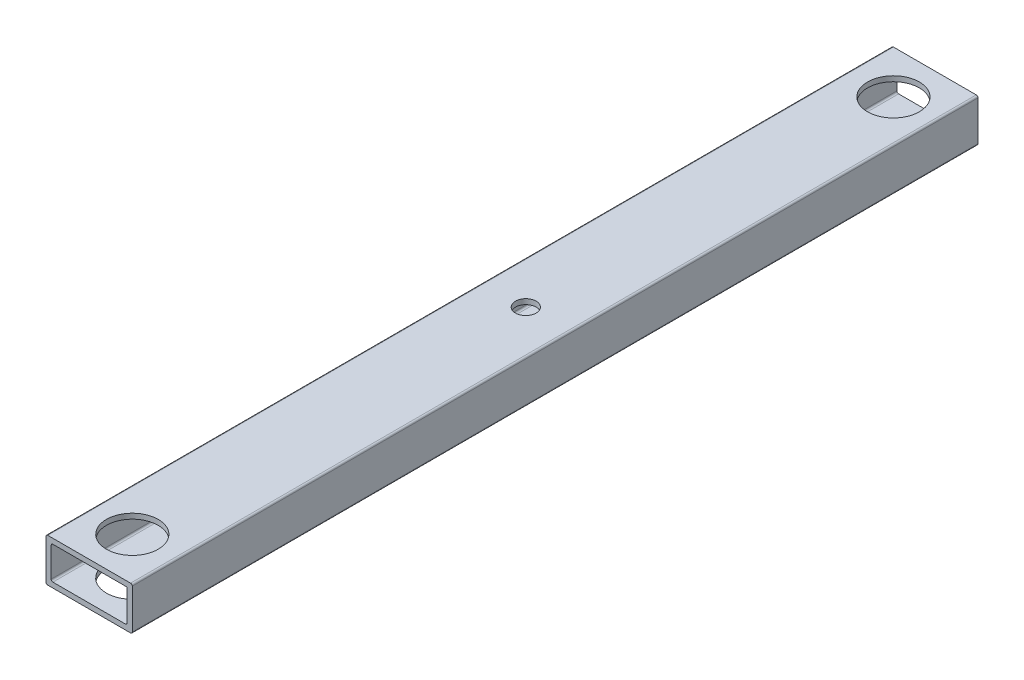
ISO-10303-21;
HEADER;
FILE_DESCRIPTION(('STEP AP214'),'2;1');
FILE_NAME('part.step','',(''),(''),'','','');
FILE_SCHEMA(('AUTOMOTIVE_DESIGN { 1 0 10303 214 1 1 1 1 }'));
ENDSEC;
DATA;
#1=APPLICATION_CONTEXT('core data for automotive mechanical design processes');
#2=APPLICATION_PROTOCOL_DEFINITION('international standard','automotive_design',2000,#1);
#3=PRODUCT_CONTEXT('',#1,'mechanical');
#4=PRODUCT('Part','Part','',(#3));
#5=PRODUCT_RELATED_PRODUCT_CATEGORY('part','',(#4));
#6=PRODUCT_DEFINITION_FORMATION('','',#4);
#7=PRODUCT_DEFINITION_CONTEXT('part definition',#1,'design');
#8=PRODUCT_DEFINITION('design','',#6,#7);
#9=PRODUCT_DEFINITION_SHAPE('','',#8);
#10=(LENGTH_UNIT() NAMED_UNIT(*) SI_UNIT(.MILLI.,.METRE.));
#11=(NAMED_UNIT(*) PLANE_ANGLE_UNIT() SI_UNIT($,.RADIAN.));
#12=(NAMED_UNIT(*) SI_UNIT($,.STERADIAN.) SOLID_ANGLE_UNIT());
#13=UNCERTAINTY_MEASURE_WITH_UNIT(LENGTH_MEASURE(1.E-05),#10,'distance_accuracy_value','');
#14=(GEOMETRIC_REPRESENTATION_CONTEXT(3) GLOBAL_UNCERTAINTY_ASSIGNED_CONTEXT((#13)) GLOBAL_UNIT_ASSIGNED_CONTEXT((#10,
#11,#12)) REPRESENTATION_CONTEXT('',''));
#15=CARTESIAN_POINT('',(0.,0.,0.));
#16=DIRECTION('',(0.,0.,1.));
#17=DIRECTION('',(1.,0.,0.));
#18=AXIS2_PLACEMENT_3D('',#15,#16,#17);
#19=CARTESIAN_POINT('',(1.,24.,490.));
#20=DIRECTION('',(0.,0.,-1.));
#21=DIRECTION('',(-1.,0.,0.));
#22=AXIS2_PLACEMENT_3D('',#19,#20,#21);
#23=PLANE('',#22);
#24=CARTESIAN_POINT('',(1.,24.,490.));
#25=DIRECTION('',(0.,0.,1.));
#26=DIRECTION('',(-1.,0.,0.));
#27=AXIS2_PLACEMENT_3D('',#24,#25,#26);
#28=CIRCLE('',#27,0.999999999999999);
#29=CARTESIAN_POINT('',(1.,25.,490.));
#30=VERTEX_POINT('',#29);
#31=CARTESIAN_POINT('',(0.,24.,490.));
#32=VERTEX_POINT('',#31);
#33=EDGE_CURVE('E217',#30,#32,#28,.T.);
#34=ORIENTED_EDGE('',*,*,#33,.T.);
#35=DIRECTION('',(0.,-1.,0.));
#36=VECTOR('',#35,1.);
#37=CARTESIAN_POINT('',(0.,1.,490.));
#38=LINE('',#37,#36);
#39=CARTESIAN_POINT('',(0.,1.,490.));
#40=VERTEX_POINT('',#39);
#41=EDGE_CURVE('E220',#32,#40,#38,.T.);
#42=ORIENTED_EDGE('',*,*,#41,.T.);
#43=CARTESIAN_POINT('',(1.,1.,490.));
#44=DIRECTION('',(0.,0.,1.));
#45=DIRECTION('',(-1.,0.,0.));
#46=AXIS2_PLACEMENT_3D('',#43,#44,#45);
#47=CIRCLE('',#46,1.);
#48=CARTESIAN_POINT('',(1.,0.,490.));
#49=VERTEX_POINT('',#48);
#50=EDGE_CURVE('E222',#40,#49,#47,.T.);
#51=ORIENTED_EDGE('',*,*,#50,.T.);
#52=DIRECTION('',(1.,0.,0.));
#53=VECTOR('',#52,1.);
#54=CARTESIAN_POINT('',(1.,0.,490.));
#55=LINE('',#54,#53);
#56=CARTESIAN_POINT('',(49.,0.,490.));
#57=VERTEX_POINT('',#56);
#58=EDGE_CURVE('E224',#49,#57,#55,.T.);
#59=ORIENTED_EDGE('',*,*,#58,.T.);
#60=CARTESIAN_POINT('',(49.,1.,490.));
#61=DIRECTION('',(0.,0.,1.));
#62=DIRECTION('',(1.,0.,0.));
#63=AXIS2_PLACEMENT_3D('',#60,#61,#62);
#64=CIRCLE('',#63,1.);
#65=CARTESIAN_POINT('',(50.,1.,490.));
#66=VERTEX_POINT('',#65);
#67=EDGE_CURVE('E226',#57,#66,#64,.T.);
#68=ORIENTED_EDGE('',*,*,#67,.T.);
#69=DIRECTION('',(0.,1.,0.));
#70=VECTOR('',#69,1.);
#71=CARTESIAN_POINT('',(50.,1.,490.));
#72=LINE('',#71,#70);
#73=CARTESIAN_POINT('',(50.,24.,490.));
#74=VERTEX_POINT('',#73);
#75=EDGE_CURVE('E228',#66,#74,#72,.T.);
#76=ORIENTED_EDGE('',*,*,#75,.T.);
#77=CARTESIAN_POINT('',(49.,24.,490.));
#78=DIRECTION('',(0.,0.,1.));
#79=DIRECTION('',(1.,0.,0.));
#80=AXIS2_PLACEMENT_3D('',#77,#78,#79);
#81=CIRCLE('',#80,0.999999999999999);
#82=CARTESIAN_POINT('',(49.,25.,490.));
#83=VERTEX_POINT('',#82);
#84=EDGE_CURVE('E230',#74,#83,#81,.T.);
#85=ORIENTED_EDGE('',*,*,#84,.T.);
#86=DIRECTION('',(-1.,0.,0.));
#87=VECTOR('',#86,1.);
#88=CARTESIAN_POINT('',(1.,25.,490.));
#89=LINE('',#88,#87);
#90=EDGE_CURVE('E232',#83,#30,#89,.T.);
#91=ORIENTED_EDGE('',*,*,#90,.T.);
#92=EDGE_LOOP('',(#34,#42,#51,#59,#68,#76,#85,#91));
#93=FACE_BOUND('',#92,.T.);
#94=DIRECTION('',(0.,1.,0.));
#95=VECTOR('',#94,1.);
#96=CARTESIAN_POINT('',(47.,4.,490.));
#97=LINE('',#96,#95);
#98=CARTESIAN_POINT('',(47.,4.,490.));
#99=VERTEX_POINT('',#98);
#100=CARTESIAN_POINT('',(47.,22.,490.));
#101=VERTEX_POINT('',#100);
#102=EDGE_CURVE('E154',#99,#101,#97,.T.);
#103=ORIENTED_EDGE('',*,*,#102,.F.);
#104=CARTESIAN_POINT('',(46.,4.,490.));
#105=DIRECTION('',(0.,0.,1.));
#106=DIRECTION('',(-1.,0.,0.));
#107=AXIS2_PLACEMENT_3D('',#104,#105,#106);
#108=CIRCLE('',#107,1.);
#109=CARTESIAN_POINT('',(46.,3.,490.));
#110=VERTEX_POINT('',#109);
#111=EDGE_CURVE('E189',#110,#99,#108,.T.);
#112=ORIENTED_EDGE('',*,*,#111,.F.);
#113=DIRECTION('',(1.,0.,0.));
#114=VECTOR('',#113,1.);
#115=CARTESIAN_POINT('',(4.,3.,490.));
#116=LINE('',#115,#114);
#117=CARTESIAN_POINT('',(4.,3.,490.));
#118=VERTEX_POINT('',#117);
#119=EDGE_CURVE('E187',#118,#110,#116,.T.);
#120=ORIENTED_EDGE('',*,*,#119,.F.);
#121=CARTESIAN_POINT('',(4.,4.,490.));
#122=DIRECTION('',(0.,0.,1.));
#123=DIRECTION('',(-1.,0.,0.));
#124=AXIS2_PLACEMENT_3D('',#121,#122,#123);
#125=CIRCLE('',#124,1.);
#126=CARTESIAN_POINT('',(3.,4.,490.));
#127=VERTEX_POINT('',#126);
#128=EDGE_CURVE('E185',#127,#118,#125,.T.);
#129=ORIENTED_EDGE('',*,*,#128,.F.);
#130=DIRECTION('',(0.,-1.,0.));
#131=VECTOR('',#130,1.);
#132=CARTESIAN_POINT('',(3.,4.,490.));
#133=LINE('',#132,#131);
#134=CARTESIAN_POINT('',(3.,21.,490.));
#135=VERTEX_POINT('',#134);
#136=EDGE_CURVE('E183',#135,#127,#133,.T.);
#137=ORIENTED_EDGE('',*,*,#136,.F.);
#138=CARTESIAN_POINT('',(4.,21.,490.));
#139=DIRECTION('',(0.,0.,1.));
#140=DIRECTION('',(-1.,0.,0.));
#141=AXIS2_PLACEMENT_3D('',#138,#139,#140);
#142=CIRCLE('',#141,1.);
#143=CARTESIAN_POINT('',(4.,22.,490.));
#144=VERTEX_POINT('',#143);
#145=EDGE_CURVE('E181',#144,#135,#142,.T.);
#146=ORIENTED_EDGE('',*,*,#145,.F.);
#147=DIRECTION('',(-1.,0.,0.));
#148=VECTOR('',#147,1.);
#149=CARTESIAN_POINT('',(4.,22.,490.));
#150=LINE('',#149,#148);
#151=EDGE_CURVE('E179',#101,#144,#150,.T.);
#152=ORIENTED_EDGE('',*,*,#151,.F.);
#153=EDGE_LOOP('',(#103,#112,#120,#129,#137,#146,#152));
#154=FACE_BOUND('',#153,.T.);
#155=ADVANCED_FACE('F30',(#93,#154),#23,.F.);
#156=CARTESIAN_POINT('',(1.,24.,0.));
#157=DIRECTION('',(0.,0.,-1.));
#158=DIRECTION('',(-1.,0.,0.));
#159=AXIS2_PLACEMENT_3D('',#156,#157,#158);
#160=PLANE('',#159);
#161=CARTESIAN_POINT('',(1.,24.,0.));
#162=DIRECTION('',(0.,0.,1.));
#163=DIRECTION('',(-1.,0.,0.));
#164=AXIS2_PLACEMENT_3D('',#161,#162,#163);
#165=CIRCLE('',#164,0.999999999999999);
#166=CARTESIAN_POINT('',(1.,25.,0.));
#167=VERTEX_POINT('',#166);
#168=CARTESIAN_POINT('',(0.,24.,0.));
#169=VERTEX_POINT('',#168);
#170=EDGE_CURVE('E155',#167,#169,#165,.T.);
#171=ORIENTED_EDGE('',*,*,#170,.F.);
#172=DIRECTION('',(-1.,0.,0.));
#173=VECTOR('',#172,1.);
#174=CARTESIAN_POINT('',(1.,25.,0.));
#175=LINE('',#174,#173);
#176=CARTESIAN_POINT('',(49.,25.,0.));
#177=VERTEX_POINT('',#176);
#178=EDGE_CURVE('E215',#177,#167,#175,.T.);
#179=ORIENTED_EDGE('',*,*,#178,.F.);
#180=CARTESIAN_POINT('',(49.,24.,0.));
#181=DIRECTION('',(0.,0.,1.));
#182=DIRECTION('',(1.,0.,0.));
#183=AXIS2_PLACEMENT_3D('',#180,#181,#182);
#184=CIRCLE('',#183,0.999999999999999);
#185=CARTESIAN_POINT('',(50.,24.,0.));
#186=VERTEX_POINT('',#185);
#187=EDGE_CURVE('E213',#186,#177,#184,.T.);
#188=ORIENTED_EDGE('',*,*,#187,.F.);
#189=DIRECTION('',(0.,1.,0.));
#190=VECTOR('',#189,1.);
#191=CARTESIAN_POINT('',(50.,1.,0.));
#192=LINE('',#191,#190);
#193=CARTESIAN_POINT('',(50.,1.,0.));
#194=VERTEX_POINT('',#193);
#195=EDGE_CURVE('E211',#194,#186,#192,.T.);
#196=ORIENTED_EDGE('',*,*,#195,.F.);
#197=CARTESIAN_POINT('',(49.,1.,0.));
#198=DIRECTION('',(0.,0.,1.));
#199=DIRECTION('',(1.,0.,0.));
#200=AXIS2_PLACEMENT_3D('',#197,#198,#199);
#201=CIRCLE('',#200,1.);
#202=CARTESIAN_POINT('',(49.,0.,0.));
#203=VERTEX_POINT('',#202);
#204=EDGE_CURVE('E209',#203,#194,#201,.T.);
#205=ORIENTED_EDGE('',*,*,#204,.F.);
#206=DIRECTION('',(1.,0.,0.));
#207=VECTOR('',#206,1.);
#208=CARTESIAN_POINT('',(1.,0.,0.));
#209=LINE('',#208,#207);
#210=CARTESIAN_POINT('',(1.,0.,0.));
#211=VERTEX_POINT('',#210);
#212=EDGE_CURVE('E207',#211,#203,#209,.T.);
#213=ORIENTED_EDGE('',*,*,#212,.F.);
#214=CARTESIAN_POINT('',(1.,1.,0.));
#215=DIRECTION('',(0.,0.,1.));
#216=DIRECTION('',(-1.,0.,0.));
#217=AXIS2_PLACEMENT_3D('',#214,#215,#216);
#218=CIRCLE('',#217,1.);
#219=CARTESIAN_POINT('',(0.,1.,0.));
#220=VERTEX_POINT('',#219);
#221=EDGE_CURVE('E205',#220,#211,#218,.T.);
#222=ORIENTED_EDGE('',*,*,#221,.F.);
#223=DIRECTION('',(0.,-1.,0.));
#224=VECTOR('',#223,1.);
#225=CARTESIAN_POINT('',(0.,1.,0.));
#226=LINE('',#225,#224);
#227=EDGE_CURVE('E203',#169,#220,#226,.T.);
#228=ORIENTED_EDGE('',*,*,#227,.F.);
#229=EDGE_LOOP('',(#171,#179,#188,#196,#205,#213,#222,#228));
#230=FACE_BOUND('',#229,.T.);
#231=CARTESIAN_POINT('',(46.,4.,0.));
#232=DIRECTION('',(0.,0.,1.));
#233=DIRECTION('',(-1.,0.,0.));
#234=AXIS2_PLACEMENT_3D('',#231,#232,#233);
#235=CIRCLE('',#234,1.);
#236=CARTESIAN_POINT('',(46.,3.,0.));
#237=VERTEX_POINT('',#236);
#238=CARTESIAN_POINT('',(47.,4.,0.));
#239=VERTEX_POINT('',#238);
#240=EDGE_CURVE('E160',#237,#239,#235,.T.);
#241=ORIENTED_EDGE('',*,*,#240,.T.);
#242=DIRECTION('',(0.,1.,0.));
#243=VECTOR('',#242,1.);
#244=CARTESIAN_POINT('',(47.,4.,0.));
#245=LINE('',#244,#243);
#246=CARTESIAN_POINT('',(47.,22.,0.));
#247=VERTEX_POINT('',#246);
#248=EDGE_CURVE('E55',#239,#247,#245,.T.);
#249=ORIENTED_EDGE('',*,*,#248,.T.);
#250=DIRECTION('',(-1.,0.,0.));
#251=VECTOR('',#250,1.);
#252=CARTESIAN_POINT('',(4.,22.,0.));
#253=LINE('',#252,#251);
#254=CARTESIAN_POINT('',(4.,22.,0.));
#255=VERTEX_POINT('',#254);
#256=EDGE_CURVE('E141',#247,#255,#253,.T.);
#257=ORIENTED_EDGE('',*,*,#256,.T.);
#258=CARTESIAN_POINT('',(4.,21.,0.));
#259=DIRECTION('',(0.,0.,1.));
#260=DIRECTION('',(-1.,0.,0.));
#261=AXIS2_PLACEMENT_3D('',#258,#259,#260);
#262=CIRCLE('',#261,1.);
#263=CARTESIAN_POINT('',(3.,21.,0.));
#264=VERTEX_POINT('',#263);
#265=EDGE_CURVE('E150',#255,#264,#262,.T.);
#266=ORIENTED_EDGE('',*,*,#265,.T.);
#267=DIRECTION('',(0.,-1.,0.));
#268=VECTOR('',#267,1.);
#269=CARTESIAN_POINT('',(3.,4.,0.));
#270=LINE('',#269,#268);
#271=CARTESIAN_POINT('',(3.,4.,0.));
#272=VERTEX_POINT('',#271);
#273=EDGE_CURVE('E169',#264,#272,#270,.T.);
#274=ORIENTED_EDGE('',*,*,#273,.T.);
#275=CARTESIAN_POINT('',(4.,4.,0.));
#276=DIRECTION('',(0.,0.,1.));
#277=DIRECTION('',(-1.,0.,0.));
#278=AXIS2_PLACEMENT_3D('',#275,#276,#277);
#279=CIRCLE('',#278,1.);
#280=CARTESIAN_POINT('',(4.,3.,0.));
#281=VERTEX_POINT('',#280);
#282=EDGE_CURVE('E172',#272,#281,#279,.T.);
#283=ORIENTED_EDGE('',*,*,#282,.T.);
#284=DIRECTION('',(1.,0.,0.));
#285=VECTOR('',#284,1.);
#286=CARTESIAN_POINT('',(4.,3.,0.));
#287=LINE('',#286,#285);
#288=EDGE_CURVE('E175',#281,#237,#287,.T.);
#289=ORIENTED_EDGE('',*,*,#288,.T.);
#290=EDGE_LOOP('',(#241,#249,#257,#266,#274,#283,#289));
#291=FACE_BOUND('',#290,.T.);
#292=ADVANCED_FACE('F158',(#230,#291),#160,.T.);
#293=CARTESIAN_POINT('',(1.,24.,490.));
#294=DIRECTION('',(0.,0.,-1.));
#295=DIRECTION('',(-1.,0.,0.));
#296=AXIS2_PLACEMENT_3D('',#293,#294,#295);
#297=CYLINDRICAL_SURFACE('',#296,0.999999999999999);
#298=ORIENTED_EDGE('',*,*,#170,.T.);
#299=DIRECTION('',(0.,0.,-1.));
#300=VECTOR('',#299,1.);
#301=CARTESIAN_POINT('',(0.,24.,490.));
#302=LINE('',#301,#300);
#303=EDGE_CURVE('E11',#32,#169,#302,.T.);
#304=ORIENTED_EDGE('',*,*,#303,.F.);
#305=ORIENTED_EDGE('',*,*,#33,.F.);
#306=DIRECTION('',(0.,0.,-1.));
#307=VECTOR('',#306,1.);
#308=CARTESIAN_POINT('',(1.,25.,490.));
#309=LINE('',#308,#307);
#310=EDGE_CURVE('E234',#30,#167,#309,.T.);
#311=ORIENTED_EDGE('',*,*,#310,.T.);
#312=EDGE_LOOP('',(#298,#304,#305,#311));
#313=FACE_BOUND('',#312,.T.);
#314=ADVANCED_FACE('F32',(#313),#297,.T.);
#315=CARTESIAN_POINT('',(0.,1.,490.));
#316=DIRECTION('',(1.,0.,0.));
#317=DIRECTION('',(0.,0.,-1.));
#318=AXIS2_PLACEMENT_3D('',#315,#316,#317);
#319=PLANE('',#318);
#320=ORIENTED_EDGE('',*,*,#227,.T.);
#321=DIRECTION('',(0.,0.,-1.));
#322=VECTOR('',#321,1.);
#323=CARTESIAN_POINT('',(0.,1.,490.));
#324=LINE('',#323,#322);
#325=EDGE_CURVE('E39',#40,#220,#324,.T.);
#326=ORIENTED_EDGE('',*,*,#325,.F.);
#327=ORIENTED_EDGE('',*,*,#41,.F.);
#328=ORIENTED_EDGE('',*,*,#303,.T.);
#329=EDGE_LOOP('',(#320,#326,#327,#328));
#330=FACE_BOUND('',#329,.T.);
#331=ADVANCED_FACE('F329',(#330),#319,.F.);
#332=CARTESIAN_POINT('',(1.,1.,490.));
#333=DIRECTION('',(0.,0.,-1.));
#334=DIRECTION('',(-1.,0.,0.));
#335=AXIS2_PLACEMENT_3D('',#332,#333,#334);
#336=CYLINDRICAL_SURFACE('',#335,1.);
#337=ORIENTED_EDGE('',*,*,#221,.T.);
#338=DIRECTION('',(0.,0.,-1.));
#339=VECTOR('',#338,1.);
#340=CARTESIAN_POINT('',(1.,0.,490.));
#341=LINE('',#340,#339);
#342=EDGE_CURVE('E249',#49,#211,#341,.T.);
#343=ORIENTED_EDGE('',*,*,#342,.F.);
#344=ORIENTED_EDGE('',*,*,#50,.F.);
#345=ORIENTED_EDGE('',*,*,#325,.T.);
#346=EDGE_LOOP('',(#337,#343,#344,#345));
#347=FACE_BOUND('',#346,.T.);
#348=ADVANCED_FACE('F326',(#347),#336,.T.);
#349=CARTESIAN_POINT('',(1.,0.,490.));
#350=DIRECTION('',(0.,1.,0.));
#351=DIRECTION('',(0.,0.,1.));
#352=AXIS2_PLACEMENT_3D('',#349,#350,#351);
#353=PLANE('',#352);
#354=CARTESIAN_POINT('',(25.0000000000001,0.,465.));
#355=DIRECTION('',(0.,1.,0.));
#356=DIRECTION('',(0.,0.,1.));
#357=AXIS2_PLACEMENT_3D('',#354,#355,#356);
#358=CIRCLE('',#357,15.);
#359=CARTESIAN_POINT('',(25.0000000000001,0.,480.));
#360=VERTEX_POINT('',#359);
#361=EDGE_CURVE('E515',#360,#360,#358,.T.);
#362=ORIENTED_EDGE('',*,*,#361,.T.);
#363=EDGE_LOOP('',(#362));
#364=FACE_BOUND('',#363,.T.);
#365=CARTESIAN_POINT('',(25.,0.,237.));
#366=DIRECTION('',(0.,1.,0.));
#367=DIRECTION('',(0.,0.,1.));
#368=AXIS2_PLACEMENT_3D('',#365,#366,#367);
#369=CIRCLE('',#368,6.00000000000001);
#370=CARTESIAN_POINT('',(25.,0.,243.));
#371=VERTEX_POINT('',#370);
#372=EDGE_CURVE('E259',#371,#371,#369,.T.);
#373=ORIENTED_EDGE('',*,*,#372,.T.);
#374=EDGE_LOOP('',(#373));
#375=FACE_BOUND('',#374,.T.);
#376=CARTESIAN_POINT('',(26.,0.,25.));
#377=DIRECTION('',(0.,1.,0.));
#378=DIRECTION('',(0.,0.,1.));
#379=AXIS2_PLACEMENT_3D('',#376,#377,#378);
#380=CIRCLE('',#379,15.);
#381=CARTESIAN_POINT('',(26.,0.,40.));
#382=VERTEX_POINT('',#381);
#383=EDGE_CURVE('E255',#382,#382,#380,.T.);
#384=ORIENTED_EDGE('',*,*,#383,.T.);
#385=EDGE_LOOP('',(#384));
#386=FACE_BOUND('',#385,.T.);
#387=ORIENTED_EDGE('',*,*,#212,.T.);
#388=DIRECTION('',(0.,0.,-1.));
#389=VECTOR('',#388,1.);
#390=CARTESIAN_POINT('',(49.,0.,490.));
#391=LINE('',#390,#389);
#392=EDGE_CURVE('E246',#57,#203,#391,.T.);
#393=ORIENTED_EDGE('',*,*,#392,.F.);
#394=ORIENTED_EDGE('',*,*,#58,.F.);
#395=ORIENTED_EDGE('',*,*,#342,.T.);
#396=EDGE_LOOP('',(#387,#393,#394,#395));
#397=FACE_BOUND('',#396,.T.);
#398=ADVANCED_FACE('F279',(#364,#375,#386,#397),#353,.F.);
#399=CARTESIAN_POINT('',(49.,1.,490.));
#400=DIRECTION('',(0.,0.,-1.));
#401=DIRECTION('',(-1.,0.,0.));
#402=AXIS2_PLACEMENT_3D('',#399,#400,#401);
#403=CYLINDRICAL_SURFACE('',#402,1.);
#404=ORIENTED_EDGE('',*,*,#204,.T.);
#405=DIRECTION('',(0.,0.,-1.));
#406=VECTOR('',#405,1.);
#407=CARTESIAN_POINT('',(50.,1.,490.));
#408=LINE('',#407,#406);
#409=EDGE_CURVE('E243',#66,#194,#408,.T.);
#410=ORIENTED_EDGE('',*,*,#409,.F.);
#411=ORIENTED_EDGE('',*,*,#67,.F.);
#412=ORIENTED_EDGE('',*,*,#392,.T.);
#413=EDGE_LOOP('',(#404,#410,#411,#412));
#414=FACE_BOUND('',#413,.T.);
#415=ADVANCED_FACE('F319',(#414),#403,.T.);
#416=CARTESIAN_POINT('',(50.,1.,490.));
#417=DIRECTION('',(-1.,0.,0.));
#418=DIRECTION('',(0.,0.,1.));
#419=AXIS2_PLACEMENT_3D('',#416,#417,#418);
#420=PLANE('',#419);
#421=ORIENTED_EDGE('',*,*,#195,.T.);
#422=DIRECTION('',(0.,0.,-1.));
#423=VECTOR('',#422,1.);
#424=CARTESIAN_POINT('',(50.,24.,490.));
#425=LINE('',#424,#423);
#426=EDGE_CURVE('E240',#74,#186,#425,.T.);
#427=ORIENTED_EDGE('',*,*,#426,.F.);
#428=ORIENTED_EDGE('',*,*,#75,.F.);
#429=ORIENTED_EDGE('',*,*,#409,.T.);
#430=EDGE_LOOP('',(#421,#427,#428,#429));
#431=FACE_BOUND('',#430,.T.);
#432=ADVANCED_FACE('F315',(#431),#420,.F.);
#433=CARTESIAN_POINT('',(49.,24.,490.));
#434=DIRECTION('',(0.,0.,-1.));
#435=DIRECTION('',(-1.,0.,0.));
#436=AXIS2_PLACEMENT_3D('',#433,#434,#435);
#437=CYLINDRICAL_SURFACE('',#436,0.999999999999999);
#438=ORIENTED_EDGE('',*,*,#187,.T.);
#439=DIRECTION('',(0.,0.,-1.));
#440=VECTOR('',#439,1.);
#441=CARTESIAN_POINT('',(49.,25.,490.));
#442=LINE('',#441,#440);
#443=EDGE_CURVE('E237',#83,#177,#442,.T.);
#444=ORIENTED_EDGE('',*,*,#443,.F.);
#445=ORIENTED_EDGE('',*,*,#84,.F.);
#446=ORIENTED_EDGE('',*,*,#426,.T.);
#447=EDGE_LOOP('',(#438,#444,#445,#446));
#448=FACE_BOUND('',#447,.T.);
#449=ADVANCED_FACE('F311',(#448),#437,.T.);
#450=CARTESIAN_POINT('',(1.,25.,490.));
#451=DIRECTION('',(0.,-1.,0.));
#452=DIRECTION('',(0.,0.,-1.));
#453=AXIS2_PLACEMENT_3D('',#450,#451,#452);
#454=PLANE('',#453);
#455=CARTESIAN_POINT('',(25.0000000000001,25.,465.));
#456=DIRECTION('',(0.,1.,0.));
#457=DIRECTION('',(0.,0.,1.));
#458=AXIS2_PLACEMENT_3D('',#455,#456,#457);
#459=CIRCLE('',#458,15.);
#460=CARTESIAN_POINT('',(25.0000000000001,25.,480.));
#461=VERTEX_POINT('',#460);
#462=EDGE_CURVE('E514',#461,#461,#459,.T.);
#463=ORIENTED_EDGE('',*,*,#462,.F.);
#464=EDGE_LOOP('',(#463));
#465=FACE_BOUND('',#464,.T.);
#466=CARTESIAN_POINT('',(25.,25.,237.));
#467=DIRECTION('',(0.,1.,0.));
#468=DIRECTION('',(0.,0.,1.));
#469=AXIS2_PLACEMENT_3D('',#466,#467,#468);
#470=CIRCLE('',#469,6.00000000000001);
#471=CARTESIAN_POINT('',(25.,25.,243.));
#472=VERTEX_POINT('',#471);
#473=EDGE_CURVE('E266',#472,#472,#470,.T.);
#474=ORIENTED_EDGE('',*,*,#473,.F.);
#475=EDGE_LOOP('',(#474));
#476=FACE_BOUND('',#475,.T.);
#477=CARTESIAN_POINT('',(26.,25.,25.));
#478=DIRECTION('',(0.,1.,0.));
#479=DIRECTION('',(0.,0.,1.));
#480=AXIS2_PLACEMENT_3D('',#477,#478,#479);
#481=CIRCLE('',#480,15.);
#482=CARTESIAN_POINT('',(26.,25.,40.));
#483=VERTEX_POINT('',#482);
#484=EDGE_CURVE('E263',#483,#483,#481,.T.);
#485=ORIENTED_EDGE('',*,*,#484,.F.);
#486=EDGE_LOOP('',(#485));
#487=FACE_BOUND('',#486,.T.);
#488=ORIENTED_EDGE('',*,*,#178,.T.);
#489=ORIENTED_EDGE('',*,*,#310,.F.);
#490=ORIENTED_EDGE('',*,*,#90,.F.);
#491=ORIENTED_EDGE('',*,*,#443,.T.);
#492=EDGE_LOOP('',(#488,#489,#490,#491));
#493=FACE_BOUND('',#492,.T.);
#494=ADVANCED_FACE('F308',(#465,#476,#487,#493),#454,.F.);
#495=CARTESIAN_POINT('',(47.,4.,490.));
#496=DIRECTION('',(-1.,0.,0.));
#497=DIRECTION('',(0.,0.,1.));
#498=AXIS2_PLACEMENT_3D('',#495,#496,#497);
#499=PLANE('',#498);
#500=ORIENTED_EDGE('',*,*,#248,.F.);
#501=DIRECTION('',(0.,0.,-1.));
#502=VECTOR('',#501,1.);
#503=CARTESIAN_POINT('',(47.,4.,490.));
#504=LINE('',#503,#502);
#505=EDGE_CURVE('E191',#99,#239,#504,.T.);
#506=ORIENTED_EDGE('',*,*,#505,.F.);
#507=ORIENTED_EDGE('',*,*,#102,.T.);
#508=DIRECTION('',(0.,0.,-1.));
#509=VECTOR('',#508,1.);
#510=CARTESIAN_POINT('',(47.,22.,490.));
#511=LINE('',#510,#509);
#512=EDGE_CURVE('E143',#101,#247,#511,.T.);
#513=ORIENTED_EDGE('',*,*,#512,.T.);
#514=EDGE_LOOP('',(#500,#506,#507,#513));
#515=FACE_BOUND('',#514,.T.);
#516=ADVANCED_FACE('F152',(#515),#499,.T.);
#517=CARTESIAN_POINT('',(4.,22.,490.));
#518=DIRECTION('',(0.,-1.,0.));
#519=DIRECTION('',(0.,0.,-1.));
#520=AXIS2_PLACEMENT_3D('',#517,#518,#519);
#521=PLANE('',#520);
#522=CARTESIAN_POINT('',(25.0000000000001,22.,465.));
#523=DIRECTION('',(0.,-1.,0.));
#524=DIRECTION('',(0.,0.,-1.));
#525=AXIS2_PLACEMENT_3D('',#522,#523,#524);
#526=CIRCLE('',#525,15.);
#527=CARTESIAN_POINT('',(25.0000000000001,22.,480.));
#528=VERTEX_POINT('',#527);
#529=EDGE_CURVE('E271',#528,#528,#526,.T.);
#530=ORIENTED_EDGE('',*,*,#529,.F.);
#531=EDGE_LOOP('',(#530));
#532=FACE_BOUND('',#531,.T.);
#533=CARTESIAN_POINT('',(25.,22.,237.));
#534=DIRECTION('',(0.,-1.,0.));
#535=DIRECTION('',(0.,0.,-1.));
#536=AXIS2_PLACEMENT_3D('',#533,#534,#535);
#537=CIRCLE('',#536,6.00000000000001);
#538=CARTESIAN_POINT('',(25.,22.,243.));
#539=VERTEX_POINT('',#538);
#540=EDGE_CURVE('E258',#539,#539,#537,.T.);
#541=ORIENTED_EDGE('',*,*,#540,.F.);
#542=EDGE_LOOP('',(#541));
#543=FACE_BOUND('',#542,.T.);
#544=CARTESIAN_POINT('',(26.,22.,25.));
#545=DIRECTION('',(0.,-1.,0.));
#546=DIRECTION('',(0.,0.,-1.));
#547=AXIS2_PLACEMENT_3D('',#544,#545,#546);
#548=CIRCLE('',#547,15.);
#549=CARTESIAN_POINT('',(26.,22.,40.));
#550=VERTEX_POINT('',#549);
#551=EDGE_CURVE('E161',#550,#550,#548,.T.);
#552=ORIENTED_EDGE('',*,*,#551,.F.);
#553=EDGE_LOOP('',(#552));
#554=FACE_BOUND('',#553,.T.);
#555=ORIENTED_EDGE('',*,*,#256,.F.);
#556=ORIENTED_EDGE('',*,*,#512,.F.);
#557=ORIENTED_EDGE('',*,*,#151,.T.);
#558=DIRECTION('',(0.,0.,-1.));
#559=VECTOR('',#558,1.);
#560=CARTESIAN_POINT('',(4.,22.,490.));
#561=LINE('',#560,#559);
#562=EDGE_CURVE('E146',#144,#255,#561,.T.);
#563=ORIENTED_EDGE('',*,*,#562,.T.);
#564=EDGE_LOOP('',(#555,#556,#557,#563));
#565=FACE_BOUND('',#564,.T.);
#566=ADVANCED_FACE('F142',(#532,#543,#554,#565),#521,.T.);
#567=CARTESIAN_POINT('',(4.,21.,490.));
#568=DIRECTION('',(0.,0.,-1.));
#569=DIRECTION('',(-1.,0.,0.));
#570=AXIS2_PLACEMENT_3D('',#567,#568,#569);
#571=CYLINDRICAL_SURFACE('',#570,1.);
#572=ORIENTED_EDGE('',*,*,#265,.F.);
#573=ORIENTED_EDGE('',*,*,#562,.F.);
#574=ORIENTED_EDGE('',*,*,#145,.T.);
#575=DIRECTION('',(0.,0.,-1.));
#576=VECTOR('',#575,1.);
#577=CARTESIAN_POINT('',(3.,21.,490.));
#578=LINE('',#577,#576);
#579=EDGE_CURVE('E198',#135,#264,#578,.T.);
#580=ORIENTED_EDGE('',*,*,#579,.T.);
#581=EDGE_LOOP('',(#572,#573,#574,#580));
#582=FACE_BOUND('',#581,.T.);
#583=ADVANCED_FACE('F424',(#582),#571,.F.);
#584=CARTESIAN_POINT('',(3.,4.,490.));
#585=DIRECTION('',(1.,0.,0.));
#586=DIRECTION('',(0.,0.,-1.));
#587=AXIS2_PLACEMENT_3D('',#584,#585,#586);
#588=PLANE('',#587);
#589=ORIENTED_EDGE('',*,*,#273,.F.);
#590=ORIENTED_EDGE('',*,*,#579,.F.);
#591=ORIENTED_EDGE('',*,*,#136,.T.);
#592=DIRECTION('',(0.,0.,-1.));
#593=VECTOR('',#592,1.);
#594=CARTESIAN_POINT('',(3.,4.,490.));
#595=LINE('',#594,#593);
#596=EDGE_CURVE('E196',#127,#272,#595,.T.);
#597=ORIENTED_EDGE('',*,*,#596,.T.);
#598=EDGE_LOOP('',(#589,#590,#591,#597));
#599=FACE_BOUND('',#598,.T.);
#600=ADVANCED_FACE('F433',(#599),#588,.T.);
#601=CARTESIAN_POINT('',(4.,4.,490.));
#602=DIRECTION('',(0.,0.,-1.));
#603=DIRECTION('',(-1.,0.,0.));
#604=AXIS2_PLACEMENT_3D('',#601,#602,#603);
#605=CYLINDRICAL_SURFACE('',#604,1.);
#606=ORIENTED_EDGE('',*,*,#282,.F.);
#607=ORIENTED_EDGE('',*,*,#596,.F.);
#608=ORIENTED_EDGE('',*,*,#128,.T.);
#609=DIRECTION('',(0.,0.,-1.));
#610=VECTOR('',#609,1.);
#611=CARTESIAN_POINT('',(4.,3.,490.));
#612=LINE('',#611,#610);
#613=EDGE_CURVE('E194',#118,#281,#612,.T.);
#614=ORIENTED_EDGE('',*,*,#613,.T.);
#615=EDGE_LOOP('',(#606,#607,#608,#614));
#616=FACE_BOUND('',#615,.T.);
#617=ADVANCED_FACE('F442',(#616),#605,.F.);
#618=CARTESIAN_POINT('',(4.,3.,490.));
#619=DIRECTION('',(0.,1.,0.));
#620=DIRECTION('',(0.,0.,1.));
#621=AXIS2_PLACEMENT_3D('',#618,#619,#620);
#622=PLANE('',#621);
#623=CARTESIAN_POINT('',(25.0000000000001,3.,465.));
#624=DIRECTION('',(0.,1.,0.));
#625=DIRECTION('',(0.,0.,1.));
#626=AXIS2_PLACEMENT_3D('',#623,#624,#625);
#627=CIRCLE('',#626,15.);
#628=CARTESIAN_POINT('',(25.0000000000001,3.,480.));
#629=VERTEX_POINT('',#628);
#630=EDGE_CURVE('E34',#629,#629,#627,.T.);
#631=ORIENTED_EDGE('',*,*,#630,.F.);
#632=EDGE_LOOP('',(#631));
#633=FACE_BOUND('',#632,.T.);
#634=CARTESIAN_POINT('',(25.,3.,237.));
#635=DIRECTION('',(0.,1.,0.));
#636=DIRECTION('',(0.,0.,1.));
#637=AXIS2_PLACEMENT_3D('',#634,#635,#636);
#638=CIRCLE('',#637,6.00000000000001);
#639=CARTESIAN_POINT('',(25.,3.,243.));
#640=VERTEX_POINT('',#639);
#641=EDGE_CURVE('E256',#640,#640,#638,.T.);
#642=ORIENTED_EDGE('',*,*,#641,.F.);
#643=EDGE_LOOP('',(#642));
#644=FACE_BOUND('',#643,.T.);
#645=CARTESIAN_POINT('',(26.,3.,25.));
#646=DIRECTION('',(0.,1.,0.));
#647=DIRECTION('',(0.,0.,1.));
#648=AXIS2_PLACEMENT_3D('',#645,#646,#647);
#649=CIRCLE('',#648,15.);
#650=CARTESIAN_POINT('',(26.,3.,40.));
#651=VERTEX_POINT('',#650);
#652=EDGE_CURVE('E164',#651,#651,#649,.T.);
#653=ORIENTED_EDGE('',*,*,#652,.F.);
#654=EDGE_LOOP('',(#653));
#655=FACE_BOUND('',#654,.T.);
#656=ORIENTED_EDGE('',*,*,#288,.F.);
#657=ORIENTED_EDGE('',*,*,#613,.F.);
#658=ORIENTED_EDGE('',*,*,#119,.T.);
#659=DIRECTION('',(0.,0.,-1.));
#660=VECTOR('',#659,1.);
#661=CARTESIAN_POINT('',(46.,3.,490.));
#662=LINE('',#661,#660);
#663=EDGE_CURVE('E47',#110,#237,#662,.T.);
#664=ORIENTED_EDGE('',*,*,#663,.T.);
#665=EDGE_LOOP('',(#656,#657,#658,#664));
#666=FACE_BOUND('',#665,.T.);
#667=ADVANCED_FACE('F294',(#633,#644,#655,#666),#622,.T.);
#668=CARTESIAN_POINT('',(46.,4.,490.));
#669=DIRECTION('',(0.,0.,-1.));
#670=DIRECTION('',(-1.,0.,0.));
#671=AXIS2_PLACEMENT_3D('',#668,#669,#670);
#672=CYLINDRICAL_SURFACE('',#671,1.);
#673=ORIENTED_EDGE('',*,*,#240,.F.);
#674=ORIENTED_EDGE('',*,*,#663,.F.);
#675=ORIENTED_EDGE('',*,*,#111,.T.);
#676=ORIENTED_EDGE('',*,*,#505,.T.);
#677=EDGE_LOOP('',(#673,#674,#675,#676));
#678=FACE_BOUND('',#677,.T.);
#679=ADVANCED_FACE('F285',(#678),#672,.F.);
#680=CARTESIAN_POINT('',(26.,0.,25.));
#681=DIRECTION('',(0.,1.,0.));
#682=DIRECTION('',(0.,0.,1.));
#683=AXIS2_PLACEMENT_3D('',#680,#681,#682);
#684=CYLINDRICAL_SURFACE('',#683,15.);
#685=CARTESIAN_POINT('',(26.,3.,40.));
#686=CARTESIAN_POINT('',(26.,2.96875,40.));
#687=CARTESIAN_POINT('',(26.,2.9375,40.));
#688=CARTESIAN_POINT('',(26.,2.875,40.));
#689=CARTESIAN_POINT('',(26.,2.84375,40.));
#690=CARTESIAN_POINT('',(26.,2.78125,40.));
#691=CARTESIAN_POINT('',(26.,2.75,40.));
#692=CARTESIAN_POINT('',(26.,2.6875,40.));
#693=CARTESIAN_POINT('',(26.,2.65625,40.));
#694=CARTESIAN_POINT('',(26.,2.59375,40.));
#695=CARTESIAN_POINT('',(26.,2.5625,40.));
#696=CARTESIAN_POINT('',(26.,2.5,40.));
#697=CARTESIAN_POINT('',(26.,2.46875,40.));
#698=CARTESIAN_POINT('',(26.,2.40625,40.));
#699=CARTESIAN_POINT('',(26.,2.375,40.));
#700=CARTESIAN_POINT('',(26.,2.3125,40.));
#701=CARTESIAN_POINT('',(26.,2.28125,40.));
#702=CARTESIAN_POINT('',(26.,2.21875,40.));
#703=CARTESIAN_POINT('',(26.,2.1875,40.));
#704=CARTESIAN_POINT('',(26.,2.125,40.));
#705=CARTESIAN_POINT('',(26.,2.09375,40.));
#706=CARTESIAN_POINT('',(26.,2.03125,40.));
#707=CARTESIAN_POINT('',(26.,2.,40.));
#708=CARTESIAN_POINT('',(26.,1.9375,40.));
#709=CARTESIAN_POINT('',(26.,1.90625,40.));
#710=CARTESIAN_POINT('',(26.,1.84375,40.));
#711=CARTESIAN_POINT('',(26.,1.8125,40.));
#712=CARTESIAN_POINT('',(26.,1.75,40.));
#713=CARTESIAN_POINT('',(26.,1.71875,40.));
#714=CARTESIAN_POINT('',(26.,1.65625,40.));
#715=CARTESIAN_POINT('',(26.,1.625,40.));
#716=CARTESIAN_POINT('',(26.,1.5625,40.));
#717=CARTESIAN_POINT('',(26.,1.53125,40.));
#718=CARTESIAN_POINT('',(26.,1.46875,40.));
#719=CARTESIAN_POINT('',(26.,1.4375,40.));
#720=CARTESIAN_POINT('',(26.,1.375,40.));
#721=CARTESIAN_POINT('',(26.,1.34375,40.));
#722=CARTESIAN_POINT('',(26.,1.28125,40.));
#723=CARTESIAN_POINT('',(26.,1.25,40.));
#724=CARTESIAN_POINT('',(26.,1.1875,40.));
#725=CARTESIAN_POINT('',(26.,1.15625,40.));
#726=CARTESIAN_POINT('',(26.,1.09375,40.));
#727=CARTESIAN_POINT('',(26.,1.0625,40.));
#728=CARTESIAN_POINT('',(26.,1.,40.));
#729=CARTESIAN_POINT('',(26.,0.96875,40.));
#730=CARTESIAN_POINT('',(26.,0.90625,40.));
#731=CARTESIAN_POINT('',(26.,0.875,40.));
#732=CARTESIAN_POINT('',(26.,0.8125,40.));
#733=CARTESIAN_POINT('',(26.,0.78125,40.));
#734=CARTESIAN_POINT('',(26.,0.71875,40.));
#735=CARTESIAN_POINT('',(26.,0.6875,40.));
#736=CARTESIAN_POINT('',(26.,0.625,40.));
#737=CARTESIAN_POINT('',(26.,0.59375,40.));
#738=CARTESIAN_POINT('',(26.,0.53125,40.));
#739=CARTESIAN_POINT('',(26.,0.5,40.));
#740=CARTESIAN_POINT('',(26.,0.4375,40.));
#741=CARTESIAN_POINT('',(26.,0.40625,40.));
#742=CARTESIAN_POINT('',(26.,0.34375,40.));
#743=CARTESIAN_POINT('',(26.,0.3125,40.));
#744=CARTESIAN_POINT('',(26.,0.25,40.));
#745=CARTESIAN_POINT('',(26.,0.21875,40.));
#746=CARTESIAN_POINT('',(26.,0.15625,40.));
#747=CARTESIAN_POINT('',(26.,0.125,40.));
#748=CARTESIAN_POINT('',(26.,0.0625000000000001,40.));
#749=CARTESIAN_POINT('',(26.,0.03125,40.));
#750=CARTESIAN_POINT('',(26.,0.,40.));
#751=B_SPLINE_CURVE_WITH_KNOTS('',3,(#685,#686,#687,#688,#689,#690,#691,#692,#693,#694,#695,
#696,#697,#698,#699,#700,#701,#702,#703,#704,#705,#706,#707,#708,#709,#710,#711,#712,#713,#714,
#715,#716,#717,#718,#719,#720,#721,#722,#723,#724,#725,#726,#727,#728,#729,#730,#731,#732,#733,
#734,#735,#736,#737,#738,#739,#740,#741,#742,#743,#744,#745,#746,#747,#748,#749,#750),
.UNSPECIFIED.,.F.,.F.,(4,2,2,2,2,2,2,2,2,2,2,2,2,2,2,2,2,2,2,2,2,2,2,2,2,2,2,2,2,2,2,2,4),(0.,
0.0937500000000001,0.1875,0.28125,0.375,0.46875,0.5625,0.65625,0.75,0.84375,0.9375,1.03125,
1.125,1.21875,1.3125,1.40625,1.5,1.59375,1.6875,1.78125,1.875,1.96875,2.0625,2.15625,2.25,
2.34375,2.4375,2.53125,2.625,2.71875,2.8125,2.90625,3.),.UNSPECIFIED.);
#752=EDGE_CURVE('BSEAM282',#651,#382,#751,.T.);
#753=ORIENTED_EDGE('',*,*,#652,.T.);
#754=ORIENTED_EDGE('',*,*,#383,.F.);
#755=ORIENTED_EDGE('',*,*,#752,.T.);
#756=ORIENTED_EDGE('',*,*,#752,.F.);
#757=EDGE_LOOP('',(#753,#755,#754,#756));
#758=FACE_BOUND('',#757,.T.);
#759=ADVANCED_FACE('F282',(#758),#684,.F.);
#760=CARTESIAN_POINT('',(26.,22.,40.));
#761=CARTESIAN_POINT('',(26.,22.03125,40.));
#762=CARTESIAN_POINT('',(26.,22.0625,40.));
#763=CARTESIAN_POINT('',(26.,22.125,40.));
#764=CARTESIAN_POINT('',(26.,22.15625,40.));
#765=CARTESIAN_POINT('',(26.,22.21875,40.));
#766=CARTESIAN_POINT('',(26.,22.25,40.));
#767=CARTESIAN_POINT('',(26.,22.3125,40.));
#768=CARTESIAN_POINT('',(26.,22.34375,40.));
#769=CARTESIAN_POINT('',(26.,22.40625,40.));
#770=CARTESIAN_POINT('',(26.,22.4375,40.));
#771=CARTESIAN_POINT('',(26.,22.5,40.));
#772=CARTESIAN_POINT('',(26.,22.53125,40.));
#773=CARTESIAN_POINT('',(26.,22.59375,40.));
#774=CARTESIAN_POINT('',(26.,22.625,40.));
#775=CARTESIAN_POINT('',(26.,22.6875,40.));
#776=CARTESIAN_POINT('',(26.,22.71875,40.));
#777=CARTESIAN_POINT('',(26.,22.78125,40.));
#778=CARTESIAN_POINT('',(26.,22.8125,40.));
#779=CARTESIAN_POINT('',(26.,22.875,40.));
#780=CARTESIAN_POINT('',(26.,22.90625,40.));
#781=CARTESIAN_POINT('',(26.,22.96875,40.));
#782=CARTESIAN_POINT('',(26.,23.,40.));
#783=CARTESIAN_POINT('',(26.,23.0625,40.));
#784=CARTESIAN_POINT('',(26.,23.09375,40.));
#785=CARTESIAN_POINT('',(26.,23.15625,40.));
#786=CARTESIAN_POINT('',(26.,23.1875,40.));
#787=CARTESIAN_POINT('',(26.,23.25,40.));
#788=CARTESIAN_POINT('',(26.,23.28125,40.));
#789=CARTESIAN_POINT('',(26.,23.34375,40.));
#790=CARTESIAN_POINT('',(26.,23.375,40.));
#791=CARTESIAN_POINT('',(26.,23.4375,40.));
#792=CARTESIAN_POINT('',(26.,23.46875,40.));
#793=CARTESIAN_POINT('',(26.,23.53125,40.));
#794=CARTESIAN_POINT('',(26.,23.5625,40.));
#795=CARTESIAN_POINT('',(26.,23.625,40.));
#796=CARTESIAN_POINT('',(26.,23.65625,40.));
#797=CARTESIAN_POINT('',(26.,23.71875,40.));
#798=CARTESIAN_POINT('',(26.,23.75,40.));
#799=CARTESIAN_POINT('',(26.,23.8125,40.));
#800=CARTESIAN_POINT('',(26.,23.84375,40.));
#801=CARTESIAN_POINT('',(26.,23.90625,40.));
#802=CARTESIAN_POINT('',(26.,23.9375,40.));
#803=CARTESIAN_POINT('',(26.,24.,40.));
#804=CARTESIAN_POINT('',(26.,24.03125,40.));
#805=CARTESIAN_POINT('',(26.,24.09375,40.));
#806=CARTESIAN_POINT('',(26.,24.125,40.));
#807=CARTESIAN_POINT('',(26.,24.1875,40.));
#808=CARTESIAN_POINT('',(26.,24.21875,40.));
#809=CARTESIAN_POINT('',(26.,24.28125,40.));
#810=CARTESIAN_POINT('',(26.,24.3125,40.));
#811=CARTESIAN_POINT('',(26.,24.375,40.));
#812=CARTESIAN_POINT('',(26.,24.40625,40.));
#813=CARTESIAN_POINT('',(26.,24.46875,40.));
#814=CARTESIAN_POINT('',(26.,24.5,40.));
#815=CARTESIAN_POINT('',(26.,24.5625,40.));
#816=CARTESIAN_POINT('',(26.,24.59375,40.));
#817=CARTESIAN_POINT('',(26.,24.65625,40.));
#818=CARTESIAN_POINT('',(26.,24.6875,40.));
#819=CARTESIAN_POINT('',(26.,24.75,40.));
#820=CARTESIAN_POINT('',(26.,24.78125,40.));
#821=CARTESIAN_POINT('',(26.,24.84375,40.));
#822=CARTESIAN_POINT('',(26.,24.875,40.));
#823=CARTESIAN_POINT('',(26.,24.9375,40.));
#824=CARTESIAN_POINT('',(26.,24.96875,40.));
#825=CARTESIAN_POINT('',(26.,25.,40.));
#826=B_SPLINE_CURVE_WITH_KNOTS('',3,(#760,#761,#762,#763,#764,#765,#766,#767,#768,#769,#770,
#771,#772,#773,#774,#775,#776,#777,#778,#779,#780,#781,#782,#783,#784,#785,#786,#787,#788,#789,
#790,#791,#792,#793,#794,#795,#796,#797,#798,#799,#800,#801,#802,#803,#804,#805,#806,#807,#808,
#809,#810,#811,#812,#813,#814,#815,#816,#817,#818,#819,#820,#821,#822,#823,#824,#825),
.UNSPECIFIED.,.F.,.F.,(4,2,2,2,2,2,2,2,2,2,2,2,2,2,2,2,2,2,2,2,2,2,2,2,2,2,2,2,2,2,2,2,4),(0.,
0.0937500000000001,0.1875,0.28125,0.375,0.46875,0.5625,0.656250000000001,0.750000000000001,
0.843749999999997,0.937499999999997,1.03125,1.125,1.21875,1.3125,1.40625,1.5,1.59375,1.6875,
1.78125,1.875,1.96875,2.0625,2.15625,2.25,2.34375,2.4375,2.53125,2.625,2.71875,2.8125,2.90625,
3.),.UNSPECIFIED.);
#827=EDGE_CURVE('BSEAM284',#550,#483,#826,.T.);
#828=ORIENTED_EDGE('',*,*,#551,.T.);
#829=ORIENTED_EDGE('',*,*,#484,.T.);
#830=ORIENTED_EDGE('',*,*,#827,.T.);
#831=ORIENTED_EDGE('',*,*,#827,.F.);
#832=EDGE_LOOP('',(#828,#830,#829,#831));
#833=FACE_BOUND('',#832,.T.);
#834=ADVANCED_FACE('F284',(#833),#684,.F.);
#835=CARTESIAN_POINT('',(25.,0.,237.));
#836=DIRECTION('',(0.,1.,0.));
#837=DIRECTION('',(0.,0.,1.));
#838=AXIS2_PLACEMENT_3D('',#835,#836,#837);
#839=CYLINDRICAL_SURFACE('',#838,6.00000000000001);
#840=CARTESIAN_POINT('',(25.,3.,243.));
#841=CARTESIAN_POINT('',(25.,2.96875,243.));
#842=CARTESIAN_POINT('',(25.,2.9375,243.));
#843=CARTESIAN_POINT('',(25.,2.875,243.));
#844=CARTESIAN_POINT('',(25.,2.84375,243.));
#845=CARTESIAN_POINT('',(25.,2.78125,243.));
#846=CARTESIAN_POINT('',(25.,2.75,243.));
#847=CARTESIAN_POINT('',(25.,2.6875,243.));
#848=CARTESIAN_POINT('',(25.,2.65625,243.));
#849=CARTESIAN_POINT('',(25.,2.59375,243.));
#850=CARTESIAN_POINT('',(25.,2.5625,243.));
#851=CARTESIAN_POINT('',(25.,2.5,243.));
#852=CARTESIAN_POINT('',(25.,2.46875,243.));
#853=CARTESIAN_POINT('',(25.,2.40625,243.));
#854=CARTESIAN_POINT('',(25.,2.375,243.));
#855=CARTESIAN_POINT('',(25.,2.3125,243.));
#856=CARTESIAN_POINT('',(25.,2.28125,243.));
#857=CARTESIAN_POINT('',(25.,2.21875,243.));
#858=CARTESIAN_POINT('',(25.,2.1875,243.));
#859=CARTESIAN_POINT('',(25.,2.125,243.));
#860=CARTESIAN_POINT('',(25.,2.09375,243.));
#861=CARTESIAN_POINT('',(25.,2.03125,243.));
#862=CARTESIAN_POINT('',(25.,2.,243.));
#863=CARTESIAN_POINT('',(25.,1.9375,243.));
#864=CARTESIAN_POINT('',(25.,1.90625,243.));
#865=CARTESIAN_POINT('',(25.,1.84375,243.));
#866=CARTESIAN_POINT('',(25.,1.8125,243.));
#867=CARTESIAN_POINT('',(25.,1.75,243.));
#868=CARTESIAN_POINT('',(25.,1.71875,243.));
#869=CARTESIAN_POINT('',(25.,1.65625,243.));
#870=CARTESIAN_POINT('',(25.,1.625,243.));
#871=CARTESIAN_POINT('',(25.,1.5625,243.));
#872=CARTESIAN_POINT('',(25.,1.53125,243.));
#873=CARTESIAN_POINT('',(25.,1.46875,243.));
#874=CARTESIAN_POINT('',(25.,1.4375,243.));
#875=CARTESIAN_POINT('',(25.,1.375,243.));
#876=CARTESIAN_POINT('',(25.,1.34375,243.));
#877=CARTESIAN_POINT('',(25.,1.28125,243.));
#878=CARTESIAN_POINT('',(25.,1.25,243.));
#879=CARTESIAN_POINT('',(25.,1.1875,243.));
#880=CARTESIAN_POINT('',(25.,1.15625,243.));
#881=CARTESIAN_POINT('',(25.,1.09375,243.));
#882=CARTESIAN_POINT('',(25.,1.0625,243.));
#883=CARTESIAN_POINT('',(25.,1.,243.));
#884=CARTESIAN_POINT('',(25.,0.96875,243.));
#885=CARTESIAN_POINT('',(25.,0.90625,243.));
#886=CARTESIAN_POINT('',(25.,0.875,243.));
#887=CARTESIAN_POINT('',(25.,0.8125,243.));
#888=CARTESIAN_POINT('',(25.,0.78125,243.));
#889=CARTESIAN_POINT('',(25.,0.71875,243.));
#890=CARTESIAN_POINT('',(25.,0.6875,243.));
#891=CARTESIAN_POINT('',(25.,0.625,243.));
#892=CARTESIAN_POINT('',(25.,0.59375,243.));
#893=CARTESIAN_POINT('',(25.,0.53125,243.));
#894=CARTESIAN_POINT('',(25.,0.5,243.));
#895=CARTESIAN_POINT('',(25.,0.4375,243.));
#896=CARTESIAN_POINT('',(25.,0.40625,243.));
#897=CARTESIAN_POINT('',(25.,0.34375,243.));
#898=CARTESIAN_POINT('',(25.,0.3125,243.));
#899=CARTESIAN_POINT('',(25.,0.25,243.));
#900=CARTESIAN_POINT('',(25.,0.21875,243.));
#901=CARTESIAN_POINT('',(25.,0.15625,243.));
#902=CARTESIAN_POINT('',(25.,0.125,243.));
#903=CARTESIAN_POINT('',(25.,0.0625000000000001,243.));
#904=CARTESIAN_POINT('',(25.,0.03125,243.));
#905=CARTESIAN_POINT('',(25.,0.,243.));
#906=B_SPLINE_CURVE_WITH_KNOTS('',3,(#840,#841,#842,#843,#844,#845,#846,#847,#848,#849,#850,
#851,#852,#853,#854,#855,#856,#857,#858,#859,#860,#861,#862,#863,#864,#865,#866,#867,#868,#869,
#870,#871,#872,#873,#874,#875,#876,#877,#878,#879,#880,#881,#882,#883,#884,#885,#886,#887,#888,
#889,#890,#891,#892,#893,#894,#895,#896,#897,#898,#899,#900,#901,#902,#903,#904,#905),
.UNSPECIFIED.,.F.,.F.,(4,2,2,2,2,2,2,2,2,2,2,2,2,2,2,2,2,2,2,2,2,2,2,2,2,2,2,2,2,2,2,2,4),(0.,
0.0937500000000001,0.1875,0.28125,0.375,0.46875,0.5625,0.65625,0.75,0.84375,0.9375,1.03125,
1.125,1.21875,1.3125,1.40625,1.5,1.59375,1.6875,1.78125,1.875,1.96875,2.0625,2.15625,2.25,
2.34375,2.4375,2.53125,2.625,2.71875,2.8125,2.90625,3.),.UNSPECIFIED.);
#907=EDGE_CURVE('BSEAM292',#640,#371,#906,.T.);
#908=ORIENTED_EDGE('',*,*,#641,.T.);
#909=ORIENTED_EDGE('',*,*,#372,.F.);
#910=ORIENTED_EDGE('',*,*,#907,.T.);
#911=ORIENTED_EDGE('',*,*,#907,.F.);
#912=EDGE_LOOP('',(#908,#910,#909,#911));
#913=FACE_BOUND('',#912,.T.);
#914=ADVANCED_FACE('F292',(#913),#839,.F.);
#915=CARTESIAN_POINT('',(25.,22.,243.));
#916=CARTESIAN_POINT('',(25.,22.03125,243.));
#917=CARTESIAN_POINT('',(25.,22.0625,243.));
#918=CARTESIAN_POINT('',(25.,22.125,243.));
#919=CARTESIAN_POINT('',(25.,22.15625,243.));
#920=CARTESIAN_POINT('',(25.,22.21875,243.));
#921=CARTESIAN_POINT('',(25.,22.25,243.));
#922=CARTESIAN_POINT('',(25.,22.3125,243.));
#923=CARTESIAN_POINT('',(25.,22.34375,243.));
#924=CARTESIAN_POINT('',(25.,22.40625,243.));
#925=CARTESIAN_POINT('',(25.,22.4375,243.));
#926=CARTESIAN_POINT('',(25.,22.5,243.));
#927=CARTESIAN_POINT('',(25.,22.53125,243.));
#928=CARTESIAN_POINT('',(25.,22.59375,243.));
#929=CARTESIAN_POINT('',(25.,22.625,243.));
#930=CARTESIAN_POINT('',(25.,22.6875,243.));
#931=CARTESIAN_POINT('',(25.,22.71875,243.));
#932=CARTESIAN_POINT('',(25.,22.78125,243.));
#933=CARTESIAN_POINT('',(25.,22.8125,243.));
#934=CARTESIAN_POINT('',(25.,22.875,243.));
#935=CARTESIAN_POINT('',(25.,22.90625,243.));
#936=CARTESIAN_POINT('',(25.,22.96875,243.));
#937=CARTESIAN_POINT('',(25.,23.,243.));
#938=CARTESIAN_POINT('',(25.,23.0625,243.));
#939=CARTESIAN_POINT('',(25.,23.09375,243.));
#940=CARTESIAN_POINT('',(25.,23.15625,243.));
#941=CARTESIAN_POINT('',(25.,23.1875,243.));
#942=CARTESIAN_POINT('',(25.,23.25,243.));
#943=CARTESIAN_POINT('',(25.,23.28125,243.));
#944=CARTESIAN_POINT('',(25.,23.34375,243.));
#945=CARTESIAN_POINT('',(25.,23.375,243.));
#946=CARTESIAN_POINT('',(25.,23.4375,243.));
#947=CARTESIAN_POINT('',(25.,23.46875,243.));
#948=CARTESIAN_POINT('',(25.,23.53125,243.));
#949=CARTESIAN_POINT('',(25.,23.5625,243.));
#950=CARTESIAN_POINT('',(25.,23.625,243.));
#951=CARTESIAN_POINT('',(25.,23.65625,243.));
#952=CARTESIAN_POINT('',(25.,23.71875,243.));
#953=CARTESIAN_POINT('',(25.,23.75,243.));
#954=CARTESIAN_POINT('',(25.,23.8125,243.));
#955=CARTESIAN_POINT('',(25.,23.84375,243.));
#956=CARTESIAN_POINT('',(25.,23.90625,243.));
#957=CARTESIAN_POINT('',(25.,23.9375,243.));
#958=CARTESIAN_POINT('',(25.,24.,243.));
#959=CARTESIAN_POINT('',(25.,24.03125,243.));
#960=CARTESIAN_POINT('',(25.,24.09375,243.));
#961=CARTESIAN_POINT('',(25.,24.125,243.));
#962=CARTESIAN_POINT('',(25.,24.1875,243.));
#963=CARTESIAN_POINT('',(25.,24.21875,243.));
#964=CARTESIAN_POINT('',(25.,24.28125,243.));
#965=CARTESIAN_POINT('',(25.,24.3125,243.));
#966=CARTESIAN_POINT('',(25.,24.375,243.));
#967=CARTESIAN_POINT('',(25.,24.40625,243.));
#968=CARTESIAN_POINT('',(25.,24.46875,243.));
#969=CARTESIAN_POINT('',(25.,24.5,243.));
#970=CARTESIAN_POINT('',(25.,24.5625,243.));
#971=CARTESIAN_POINT('',(25.,24.59375,243.));
#972=CARTESIAN_POINT('',(25.,24.65625,243.));
#973=CARTESIAN_POINT('',(25.,24.6875,243.));
#974=CARTESIAN_POINT('',(25.,24.75,243.));
#975=CARTESIAN_POINT('',(25.,24.78125,243.));
#976=CARTESIAN_POINT('',(25.,24.84375,243.));
#977=CARTESIAN_POINT('',(25.,24.875,243.));
#978=CARTESIAN_POINT('',(25.,24.9375,243.));
#979=CARTESIAN_POINT('',(25.,24.96875,243.));
#980=CARTESIAN_POINT('',(25.,25.,243.));
#981=B_SPLINE_CURVE_WITH_KNOTS('',3,(#915,#916,#917,#918,#919,#920,#921,#922,#923,#924,#925,
#926,#927,#928,#929,#930,#931,#932,#933,#934,#935,#936,#937,#938,#939,#940,#941,#942,#943,#944,
#945,#946,#947,#948,#949,#950,#951,#952,#953,#954,#955,#956,#957,#958,#959,#960,#961,#962,#963,
#964,#965,#966,#967,#968,#969,#970,#971,#972,#973,#974,#975,#976,#977,#978,#979,#980),
.UNSPECIFIED.,.F.,.F.,(4,2,2,2,2,2,2,2,2,2,2,2,2,2,2,2,2,2,2,2,2,2,2,2,2,2,2,2,2,2,2,2,4),(0.,
0.0937500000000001,0.1875,0.28125,0.375,0.46875,0.5625,0.656250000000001,0.750000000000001,
0.843749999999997,0.937499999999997,1.03125,1.125,1.21875,1.3125,1.40625,1.5,1.59375,1.6875,
1.78125,1.875,1.96875,2.0625,2.15625,2.25,2.34375,2.4375,2.53125,2.625,2.71875,2.8125,2.90625,
3.),.UNSPECIFIED.);
#982=EDGE_CURVE('BSEAM479',#539,#472,#981,.T.);
#983=ORIENTED_EDGE('',*,*,#540,.T.);
#984=ORIENTED_EDGE('',*,*,#473,.T.);
#985=ORIENTED_EDGE('',*,*,#982,.T.);
#986=ORIENTED_EDGE('',*,*,#982,.F.);
#987=EDGE_LOOP('',(#983,#985,#984,#986));
#988=FACE_BOUND('',#987,.T.);
#989=ADVANCED_FACE('F479',(#988),#839,.F.);
#990=CARTESIAN_POINT('',(25.0000000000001,0.,465.));
#991=DIRECTION('',(0.,1.,0.));
#992=DIRECTION('',(0.,0.,1.));
#993=AXIS2_PLACEMENT_3D('',#990,#991,#992);
#994=CYLINDRICAL_SURFACE('',#993,15.);
#995=CARTESIAN_POINT('',(25.0000000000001,3.,480.));
#996=CARTESIAN_POINT('',(25.0000000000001,2.96875,480.));
#997=CARTESIAN_POINT('',(25.0000000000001,2.9375,480.));
#998=CARTESIAN_POINT('',(25.0000000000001,2.875,480.));
#999=CARTESIAN_POINT('',(25.0000000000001,2.84375,480.));
#1000=CARTESIAN_POINT('',(25.0000000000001,2.78125,480.));
#1001=CARTESIAN_POINT('',(25.0000000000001,2.75,480.));
#1002=CARTESIAN_POINT('',(25.0000000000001,2.6875,480.));
#1003=CARTESIAN_POINT('',(25.0000000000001,2.65625,480.));
#1004=CARTESIAN_POINT('',(25.0000000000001,2.59375,480.));
#1005=CARTESIAN_POINT('',(25.0000000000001,2.5625,480.));
#1006=CARTESIAN_POINT('',(25.0000000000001,2.5,480.));
#1007=CARTESIAN_POINT('',(25.0000000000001,2.46875,480.));
#1008=CARTESIAN_POINT('',(25.0000000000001,2.40625,480.));
#1009=CARTESIAN_POINT('',(25.0000000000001,2.375,480.));
#1010=CARTESIAN_POINT('',(25.0000000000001,2.3125,480.));
#1011=CARTESIAN_POINT('',(25.0000000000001,2.28125,480.));
#1012=CARTESIAN_POINT('',(25.0000000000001,2.21875,480.));
#1013=CARTESIAN_POINT('',(25.0000000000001,2.1875,480.));
#1014=CARTESIAN_POINT('',(25.0000000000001,2.125,480.));
#1015=CARTESIAN_POINT('',(25.0000000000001,2.09375,480.));
#1016=CARTESIAN_POINT('',(25.0000000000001,2.03125,480.));
#1017=CARTESIAN_POINT('',(25.0000000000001,2.,480.));
#1018=CARTESIAN_POINT('',(25.0000000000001,1.9375,480.));
#1019=CARTESIAN_POINT('',(25.0000000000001,1.90625,480.));
#1020=CARTESIAN_POINT('',(25.0000000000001,1.84375,480.));
#1021=CARTESIAN_POINT('',(25.0000000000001,1.8125,480.));
#1022=CARTESIAN_POINT('',(25.0000000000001,1.75,480.));
#1023=CARTESIAN_POINT('',(25.0000000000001,1.71875,480.));
#1024=CARTESIAN_POINT('',(25.0000000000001,1.65625,480.));
#1025=CARTESIAN_POINT('',(25.0000000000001,1.625,480.));
#1026=CARTESIAN_POINT('',(25.0000000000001,1.5625,480.));
#1027=CARTESIAN_POINT('',(25.0000000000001,1.53125,480.));
#1028=CARTESIAN_POINT('',(25.0000000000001,1.46875,480.));
#1029=CARTESIAN_POINT('',(25.0000000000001,1.4375,480.));
#1030=CARTESIAN_POINT('',(25.0000000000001,1.375,480.));
#1031=CARTESIAN_POINT('',(25.0000000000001,1.34375,480.));
#1032=CARTESIAN_POINT('',(25.0000000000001,1.28125,480.));
#1033=CARTESIAN_POINT('',(25.0000000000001,1.25,480.));
#1034=CARTESIAN_POINT('',(25.0000000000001,1.1875,480.));
#1035=CARTESIAN_POINT('',(25.0000000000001,1.15625,480.));
#1036=CARTESIAN_POINT('',(25.0000000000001,1.09375,480.));
#1037=CARTESIAN_POINT('',(25.0000000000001,1.0625,480.));
#1038=CARTESIAN_POINT('',(25.0000000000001,1.,480.));
#1039=CARTESIAN_POINT('',(25.0000000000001,0.96875,480.));
#1040=CARTESIAN_POINT('',(25.0000000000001,0.90625,480.));
#1041=CARTESIAN_POINT('',(25.0000000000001,0.875,480.));
#1042=CARTESIAN_POINT('',(25.0000000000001,0.8125,480.));
#1043=CARTESIAN_POINT('',(25.0000000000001,0.78125,480.));
#1044=CARTESIAN_POINT('',(25.0000000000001,0.71875,480.));
#1045=CARTESIAN_POINT('',(25.0000000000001,0.6875,480.));
#1046=CARTESIAN_POINT('',(25.0000000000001,0.625,480.));
#1047=CARTESIAN_POINT('',(25.0000000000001,0.59375,480.));
#1048=CARTESIAN_POINT('',(25.0000000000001,0.53125,480.));
#1049=CARTESIAN_POINT('',(25.0000000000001,0.5,480.));
#1050=CARTESIAN_POINT('',(25.0000000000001,0.4375,480.));
#1051=CARTESIAN_POINT('',(25.0000000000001,0.40625,480.));
#1052=CARTESIAN_POINT('',(25.0000000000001,0.34375,480.));
#1053=CARTESIAN_POINT('',(25.0000000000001,0.3125,480.));
#1054=CARTESIAN_POINT('',(25.0000000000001,0.25,480.));
#1055=CARTESIAN_POINT('',(25.0000000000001,0.21875,480.));
#1056=CARTESIAN_POINT('',(25.0000000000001,0.15625,480.));
#1057=CARTESIAN_POINT('',(25.0000000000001,0.125,480.));
#1058=CARTESIAN_POINT('',(25.0000000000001,0.0625000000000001,480.));
#1059=CARTESIAN_POINT('',(25.0000000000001,0.03125,480.));
#1060=CARTESIAN_POINT('',(25.0000000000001,0.,480.));
#1061=B_SPLINE_CURVE_WITH_KNOTS('',3,(#995,#996,#997,#998,#999,#1000,#1001,#1002,#1003,#1004,
#1005,#1006,#1007,#1008,#1009,#1010,#1011,#1012,#1013,#1014,#1015,#1016,#1017,#1018,#1019,#1020,
#1021,#1022,#1023,#1024,#1025,#1026,#1027,#1028,#1029,#1030,#1031,#1032,#1033,#1034,#1035,#1036,
#1037,#1038,#1039,#1040,#1041,#1042,#1043,#1044,#1045,#1046,#1047,#1048,#1049,#1050,#1051,#1052,
#1053,#1054,#1055,#1056,#1057,#1058,#1059,#1060),.UNSPECIFIED.,.F.,.F.,(4,2,2,2,2,2,2,2,2,2,2,2,
2,2,2,2,2,2,2,2,2,2,2,2,2,2,2,2,2,2,2,2,4),(0.,0.0937500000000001,0.1875,0.28125,0.375,0.46875,
0.5625,0.65625,0.75,0.84375,0.9375,1.03125,1.125,1.21875,1.3125,1.40625,1.5,1.59375,1.6875,
1.78125,1.875,1.96875,2.0625,2.15625,2.25,2.34375,2.4375,2.53125,2.625,2.71875,2.8125,2.90625,
3.),.UNSPECIFIED.);
#1062=EDGE_CURVE('BSEAM486',#629,#360,#1061,.T.);
#1063=ORIENTED_EDGE('',*,*,#630,.T.);
#1064=ORIENTED_EDGE('',*,*,#361,.F.);
#1065=ORIENTED_EDGE('',*,*,#1062,.T.);
#1066=ORIENTED_EDGE('',*,*,#1062,.F.);
#1067=EDGE_LOOP('',(#1063,#1065,#1064,#1066));
#1068=FACE_BOUND('',#1067,.T.);
#1069=ADVANCED_FACE('F486',(#1068),#994,.F.);
#1070=CARTESIAN_POINT('',(25.0000000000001,22.,480.));
#1071=CARTESIAN_POINT('',(25.0000000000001,22.03125,480.));
#1072=CARTESIAN_POINT('',(25.0000000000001,22.0625,480.));
#1073=CARTESIAN_POINT('',(25.0000000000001,22.125,480.));
#1074=CARTESIAN_POINT('',(25.0000000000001,22.15625,480.));
#1075=CARTESIAN_POINT('',(25.0000000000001,22.21875,480.));
#1076=CARTESIAN_POINT('',(25.0000000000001,22.25,480.));
#1077=CARTESIAN_POINT('',(25.0000000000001,22.3125,480.));
#1078=CARTESIAN_POINT('',(25.0000000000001,22.34375,480.));
#1079=CARTESIAN_POINT('',(25.0000000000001,22.40625,480.));
#1080=CARTESIAN_POINT('',(25.0000000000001,22.4375,480.));
#1081=CARTESIAN_POINT('',(25.0000000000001,22.5,480.));
#1082=CARTESIAN_POINT('',(25.0000000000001,22.53125,480.));
#1083=CARTESIAN_POINT('',(25.0000000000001,22.59375,480.));
#1084=CARTESIAN_POINT('',(25.0000000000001,22.625,480.));
#1085=CARTESIAN_POINT('',(25.0000000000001,22.6875,480.));
#1086=CARTESIAN_POINT('',(25.0000000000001,22.71875,480.));
#1087=CARTESIAN_POINT('',(25.0000000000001,22.78125,480.));
#1088=CARTESIAN_POINT('',(25.0000000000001,22.8125,480.));
#1089=CARTESIAN_POINT('',(25.0000000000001,22.875,480.));
#1090=CARTESIAN_POINT('',(25.0000000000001,22.90625,480.));
#1091=CARTESIAN_POINT('',(25.0000000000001,22.96875,480.));
#1092=CARTESIAN_POINT('',(25.0000000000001,23.,480.));
#1093=CARTESIAN_POINT('',(25.0000000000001,23.0625,480.));
#1094=CARTESIAN_POINT('',(25.0000000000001,23.09375,480.));
#1095=CARTESIAN_POINT('',(25.0000000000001,23.15625,480.));
#1096=CARTESIAN_POINT('',(25.0000000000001,23.1875,480.));
#1097=CARTESIAN_POINT('',(25.0000000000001,23.25,480.));
#1098=CARTESIAN_POINT('',(25.0000000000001,23.28125,480.));
#1099=CARTESIAN_POINT('',(25.0000000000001,23.34375,480.));
#1100=CARTESIAN_POINT('',(25.0000000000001,23.375,480.));
#1101=CARTESIAN_POINT('',(25.0000000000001,23.4375,480.));
#1102=CARTESIAN_POINT('',(25.0000000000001,23.46875,480.));
#1103=CARTESIAN_POINT('',(25.0000000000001,23.53125,480.));
#1104=CARTESIAN_POINT('',(25.0000000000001,23.5625,480.));
#1105=CARTESIAN_POINT('',(25.0000000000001,23.625,480.));
#1106=CARTESIAN_POINT('',(25.0000000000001,23.65625,480.));
#1107=CARTESIAN_POINT('',(25.0000000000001,23.71875,480.));
#1108=CARTESIAN_POINT('',(25.0000000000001,23.75,480.));
#1109=CARTESIAN_POINT('',(25.0000000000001,23.8125,480.));
#1110=CARTESIAN_POINT('',(25.0000000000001,23.84375,480.));
#1111=CARTESIAN_POINT('',(25.0000000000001,23.90625,480.));
#1112=CARTESIAN_POINT('',(25.0000000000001,23.9375,480.));
#1113=CARTESIAN_POINT('',(25.0000000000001,24.,480.));
#1114=CARTESIAN_POINT('',(25.0000000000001,24.03125,480.));
#1115=CARTESIAN_POINT('',(25.0000000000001,24.09375,480.));
#1116=CARTESIAN_POINT('',(25.0000000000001,24.125,480.));
#1117=CARTESIAN_POINT('',(25.0000000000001,24.1875,480.));
#1118=CARTESIAN_POINT('',(25.0000000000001,24.21875,480.));
#1119=CARTESIAN_POINT('',(25.0000000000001,24.28125,480.));
#1120=CARTESIAN_POINT('',(25.0000000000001,24.3125,480.));
#1121=CARTESIAN_POINT('',(25.0000000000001,24.375,480.));
#1122=CARTESIAN_POINT('',(25.0000000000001,24.40625,480.));
#1123=CARTESIAN_POINT('',(25.0000000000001,24.46875,480.));
#1124=CARTESIAN_POINT('',(25.0000000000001,24.5,480.));
#1125=CARTESIAN_POINT('',(25.0000000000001,24.5625,480.));
#1126=CARTESIAN_POINT('',(25.0000000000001,24.59375,480.));
#1127=CARTESIAN_POINT('',(25.0000000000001,24.65625,480.));
#1128=CARTESIAN_POINT('',(25.0000000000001,24.6875,480.));
#1129=CARTESIAN_POINT('',(25.0000000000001,24.75,480.));
#1130=CARTESIAN_POINT('',(25.0000000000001,24.78125,480.));
#1131=CARTESIAN_POINT('',(25.0000000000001,24.84375,480.));
#1132=CARTESIAN_POINT('',(25.0000000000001,24.875,480.));
#1133=CARTESIAN_POINT('',(25.0000000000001,24.9375,480.));
#1134=CARTESIAN_POINT('',(25.0000000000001,24.96875,480.));
#1135=CARTESIAN_POINT('',(25.0000000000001,25.,480.));
#1136=B_SPLINE_CURVE_WITH_KNOTS('',3,(#1070,#1071,#1072,#1073,#1074,#1075,#1076,#1077,#1078,
#1079,#1080,#1081,#1082,#1083,#1084,#1085,#1086,#1087,#1088,#1089,#1090,#1091,#1092,#1093,#1094,
#1095,#1096,#1097,#1098,#1099,#1100,#1101,#1102,#1103,#1104,#1105,#1106,#1107,#1108,#1109,#1110,
#1111,#1112,#1113,#1114,#1115,#1116,#1117,#1118,#1119,#1120,#1121,#1122,#1123,#1124,#1125,#1126,
#1127,#1128,#1129,#1130,#1131,#1132,#1133,#1134,#1135),.UNSPECIFIED.,.F.,.F.,(4,2,2,2,2,2,2,2,2,
2,2,2,2,2,2,2,2,2,2,2,2,2,2,2,2,2,2,2,2,2,2,2,4),(0.,0.0937500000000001,0.1875,0.28125,0.375,
0.46875,0.5625,0.656250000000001,0.750000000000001,0.843749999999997,0.937499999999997,1.03125,
1.125,1.21875,1.3125,1.40625,1.5,1.59375,1.6875,1.78125,1.875,1.96875,2.0625,2.15625,2.25,
2.34375,2.4375,2.53125,2.625,2.71875,2.8125,2.90625,3.),.UNSPECIFIED.);
#1137=EDGE_CURVE('BSEAM494',#528,#461,#1136,.T.);
#1138=ORIENTED_EDGE('',*,*,#529,.T.);
#1139=ORIENTED_EDGE('',*,*,#462,.T.);
#1140=ORIENTED_EDGE('',*,*,#1137,.T.);
#1141=ORIENTED_EDGE('',*,*,#1137,.F.);
#1142=EDGE_LOOP('',(#1138,#1140,#1139,#1141));
#1143=FACE_BOUND('',#1142,.T.);
#1144=ADVANCED_FACE('F494',(#1143),#994,.F.);
#1145=CLOSED_SHELL('',(#155,#292,#314,#331,#348,#398,#415,#432,#449,#494,#516,#566,#583,#600,
#617,#667,#679,#759,#834,#914,#989,#1069,#1144));
#1146=MANIFOLD_SOLID_BREP('B2',#1145);
#1147=ADVANCED_BREP_SHAPE_REPRESENTATION('',(#18,#1146),#14);
#1148=SHAPE_DEFINITION_REPRESENTATION(#9,#1147);
ENDSEC;
END-ISO-10303-21;
